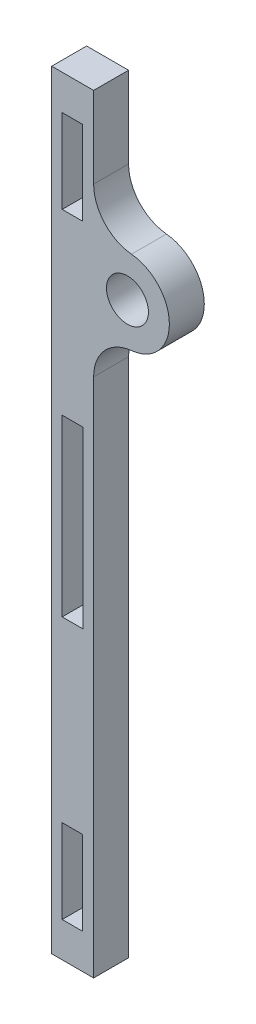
from build123d import *

# Parameters (mm, degrees)
SKIZZE1_R                       = 3
SKIZZE1_W                       = 2.9
SKIZZE1_H                       = 12
SKIZZE1_W_2                     = 3
SKIZZE1_H_2                     = 25
AUFSATZ_LINEAR_AUSTRAGEN1_DEPTH = 5


with BuildPart() as part:
    # Skizze1 → Aufsatz-Linear austragen1 (new body)
    with BuildSketch(Plane.XY):
        with BuildLine():
            Line((-219.099771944, -16.458223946), (-219.099771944, -90.95171902))
            Line((-219.099771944, -90.95171902), (-225.099771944, -90.95171902))
            Line((-225.099771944, -90.95171902), (-225.099771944, 19.04828098))
            Line((-225.099771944, 19.04828098), (-219.099771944, 19.04828098))
            Line((-219.099771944, 19.04828098), (-219.099771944, 7.429160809))
            ThreePointArc((-219.099771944, 7.429160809), (-217.542933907, 3.397001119), (-213.680334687, 1.457314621))
            ThreePointArc((-213.680334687, 1.457314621), (-208.260897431, -4.514531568), (-213.680334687, -10.486377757))
            ThreePointArc((-213.680334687, -10.486377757), (-217.542933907, -12.426064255), (-219.099771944, -16.458223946))
        make_face()
        with Locations((-214.260897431, -4.514531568)):
            Circle(SKIZZE1_R, mode=Mode.SUBTRACT)
        with Locations((-222.149771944, 8.04828098)):
            Rectangle(SKIZZE1_W, SKIZZE1_H, mode=Mode.SUBTRACT)
        with Locations((-222.149771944, -79.95171902)):
            Rectangle(SKIZZE1_W, SKIZZE1_H, mode=Mode.SUBTRACT)
        with Locations((-222.099771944, -35.95171902)):
            Rectangle(SKIZZE1_W_2, SKIZZE1_H_2, mode=Mode.SUBTRACT)
    extrude(amount=AUFSATZ_LINEAR_AUSTRAGEN1_DEPTH)


solid = part.part
